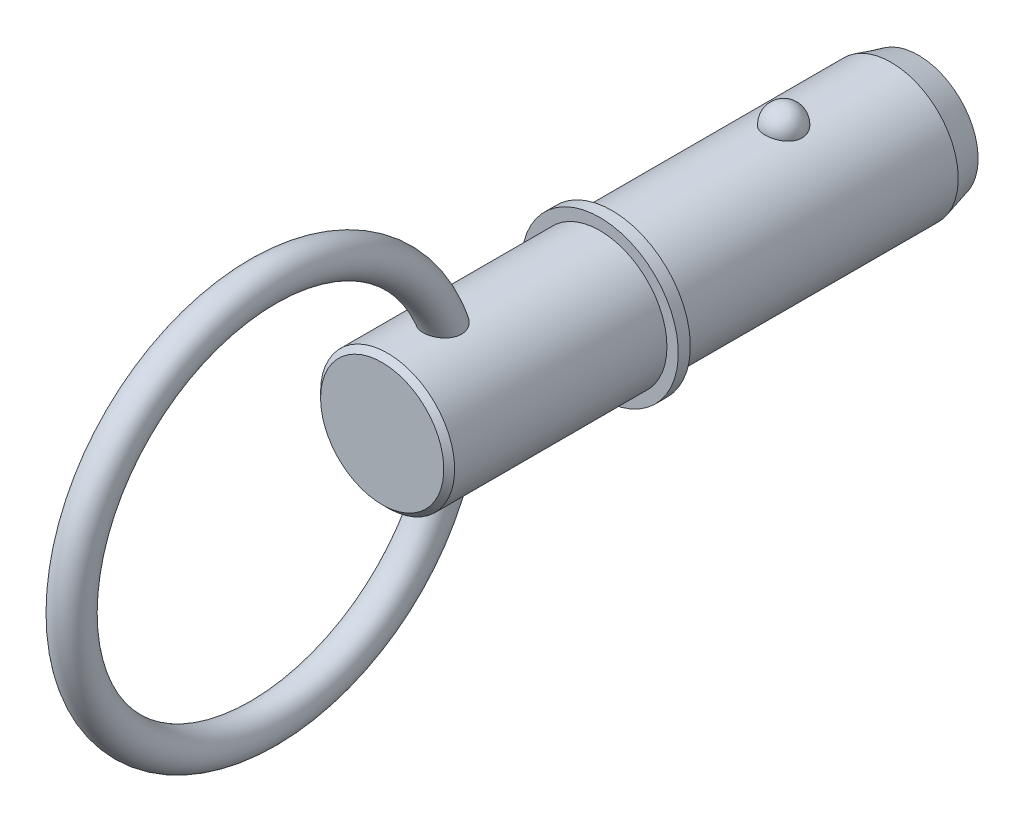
ISO-10303-21;
HEADER;
FILE_DESCRIPTION(('STEP AP214'),'2;1');
FILE_NAME('part.step','',(''),(''),'','','');
FILE_SCHEMA(('AUTOMOTIVE_DESIGN { 1 0 10303 214 1 1 1 1 }'));
ENDSEC;
DATA;
#1=APPLICATION_CONTEXT('core data for automotive mechanical design processes');
#2=APPLICATION_PROTOCOL_DEFINITION('international standard','automotive_design',2000,#1);
#3=PRODUCT_CONTEXT('',#1,'mechanical');
#4=PRODUCT('Part','Part','',(#3));
#5=PRODUCT_RELATED_PRODUCT_CATEGORY('part','',(#4));
#6=PRODUCT_DEFINITION_FORMATION('','',#4);
#7=PRODUCT_DEFINITION_CONTEXT('part definition',#1,'design');
#8=PRODUCT_DEFINITION('design','',#6,#7);
#9=PRODUCT_DEFINITION_SHAPE('','',#8);
#10=(LENGTH_UNIT() NAMED_UNIT(*) SI_UNIT(.MILLI.,.METRE.));
#11=(NAMED_UNIT(*) PLANE_ANGLE_UNIT() SI_UNIT($,.RADIAN.));
#12=(NAMED_UNIT(*) SI_UNIT($,.STERADIAN.) SOLID_ANGLE_UNIT());
#13=UNCERTAINTY_MEASURE_WITH_UNIT(LENGTH_MEASURE(1.E-05),#10,'distance_accuracy_value','');
#14=(GEOMETRIC_REPRESENTATION_CONTEXT(3) GLOBAL_UNCERTAINTY_ASSIGNED_CONTEXT((#13)) GLOBAL_UNIT_ASSIGNED_CONTEXT((#10,
#11,#12)) REPRESENTATION_CONTEXT('',''));
#15=CARTESIAN_POINT('',(0.,0.,0.));
#16=DIRECTION('',(0.,0.,1.));
#17=DIRECTION('',(1.,0.,0.));
#18=AXIS2_PLACEMENT_3D('',#15,#16,#17);
#19=CARTESIAN_POINT('',(0.,0.,25.4));
#20=DIRECTION('',(0.,0.,-1.));
#21=DIRECTION('',(-1.,0.,0.));
#22=AXIS2_PLACEMENT_3D('',#19,#20,#21);
#23=CYLINDRICAL_SURFACE('',#22,11.115);
#24=CARTESIAN_POINT('',(3.04058343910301,10.6910278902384,-3.06999999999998));
#25=CARTESIAN_POINT('',(3.04058039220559,10.6910304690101,-2.89837124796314));
#26=CARTESIAN_POINT('',(3.02657193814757,10.6950430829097,-2.72670368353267));
#27=CARTESIAN_POINT('',(2.97087341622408,10.7106465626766,-2.38822964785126));
#28=CARTESIAN_POINT('',(2.92917240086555,10.7222404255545,-2.22142512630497));
#29=CARTESIAN_POINT('',(2.81915317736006,10.751689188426,-1.8975081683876));
#30=CARTESIAN_POINT('',(2.75084669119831,10.7695413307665,-1.74039149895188));
#31=CARTESIAN_POINT('',(2.58932284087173,10.809510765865,-1.44013959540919));
#32=CARTESIAN_POINT('',(2.49610617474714,10.8316279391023,-1.29700396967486));
#33=CARTESIAN_POINT('',(2.28659317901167,10.877786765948,-1.02797591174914));
#34=CARTESIAN_POINT('',(2.17018825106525,10.9018371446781,-0.9021695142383));
#35=CARTESIAN_POINT('',(1.91759004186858,10.9490888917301,-0.672091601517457));
#36=CARTESIAN_POINT('',(1.78139672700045,10.9722902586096,-0.567820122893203));
#37=CARTESIAN_POINT('',(1.49327884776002,11.0151925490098,-0.383992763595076));
#38=CARTESIAN_POINT('',(1.34139928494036,11.034903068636,-0.304368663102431));
#39=CARTESIAN_POINT('',(1.0258482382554,11.0686948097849,-0.171731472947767));
#40=CARTESIAN_POINT('',(0.862178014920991,11.0827766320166,-0.118715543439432));
#41=CARTESIAN_POINT('',(0.530748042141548,11.1035404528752,-0.0415304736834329));
#42=CARTESIAN_POINT('',(0.363109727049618,11.1103474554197,-0.0168734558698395));
#43=CARTESIAN_POINT('',(0.0259327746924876,11.1162480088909,0.00453486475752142));
#44=CARTESIAN_POINT('',(-0.143605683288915,11.1153422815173,0.00128877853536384));
#45=CARTESIAN_POINT('',(-0.477280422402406,11.1059854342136,-0.0327676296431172));
#46=CARTESIAN_POINT('',(-0.641459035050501,11.0976393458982,-0.06319427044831));
#47=CARTESIAN_POINT('',(-0.962236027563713,11.0744390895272,-0.150220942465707));
#48=CARTESIAN_POINT('',(-1.11883427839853,11.0595848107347,-0.206821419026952));
#49=CARTESIAN_POINT('',(-1.4210461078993,11.0248420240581,-0.345028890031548));
#50=CARTESIAN_POINT('',(-1.56659244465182,11.0049254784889,-0.426775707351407));
#51=CARTESIAN_POINT('',(-1.84189316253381,10.9622119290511,-0.612956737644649));
#52=CARTESIAN_POINT('',(-1.97164597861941,10.9394146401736,-0.717393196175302));
#53=CARTESIAN_POINT('',(-2.21432263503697,10.8929139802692,-0.948332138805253));
#54=CARTESIAN_POINT('',(-2.3268890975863,10.8692016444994,-1.075208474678));
#55=CARTESIAN_POINT('',(-2.52940007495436,10.8238699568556,-1.34622145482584));
#56=CARTESIAN_POINT('',(-2.6193430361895,10.8022507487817,-1.49035928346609));
#57=CARTESIAN_POINT('',(-2.77523958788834,10.7632629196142,-1.79367507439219));
#58=CARTESIAN_POINT('',(-2.84091512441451,10.7459442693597,-1.95300253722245));
#59=CARTESIAN_POINT('',(-2.94519180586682,10.7178360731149,-2.28083009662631));
#60=CARTESIAN_POINT('',(-2.98379371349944,10.707046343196,-2.44932993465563));
#61=CARTESIAN_POINT('',(-3.03284665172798,10.6932559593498,-2.78998091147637));
#62=CARTESIAN_POINT('',(-3.04341313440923,10.6902233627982,-2.96211412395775));
#63=CARTESIAN_POINT('',(-3.03646037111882,10.6922002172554,-3.30576225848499));
#64=CARTESIAN_POINT('',(-3.0189418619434,10.6972094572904,-3.47727719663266));
#65=CARTESIAN_POINT('',(-2.95641582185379,10.7146564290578,-3.81396465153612));
#66=CARTESIAN_POINT('',(-2.91154117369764,10.7270582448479,-3.97916375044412));
#67=CARTESIAN_POINT('',(-2.79553341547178,10.7578713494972,-4.29947360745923));
#68=CARTESIAN_POINT('',(-2.72439927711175,10.7762828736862,-4.45458397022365));
#69=CARTESIAN_POINT('',(-2.55718900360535,10.8171819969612,-4.7512355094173));
#70=CARTESIAN_POINT('',(-2.46098224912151,10.8396907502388,-4.89270014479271));
#71=CARTESIAN_POINT('',(-2.24623042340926,10.8862165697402,-5.15724095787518));
#72=CARTESIAN_POINT('',(-2.12768452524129,10.9102336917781,-5.28031645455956));
#73=CARTESIAN_POINT('',(-1.87085107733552,10.9571990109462,-5.50509615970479));
#74=CARTESIAN_POINT('',(-1.73249451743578,10.9801430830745,-5.6067224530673));
#75=CARTESIAN_POINT('',(-1.44010079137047,11.0223008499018,-5.78517789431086));
#76=CARTESIAN_POINT('',(-1.28606470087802,11.0415148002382,-5.86200874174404));
#77=CARTESIAN_POINT('',(-0.968615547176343,11.0738491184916,-5.98788441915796));
#78=CARTESIAN_POINT('',(-0.805339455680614,11.0870408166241,-6.03725610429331));
#79=CARTESIAN_POINT('',(-0.472449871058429,11.1062048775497,-6.10820004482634));
#80=CARTESIAN_POINT('',(-0.302837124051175,11.11217808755,-6.12977556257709));
#81=CARTESIAN_POINT('',(0.0345765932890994,11.1162034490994,-6.14436196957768));
#82=CARTESIAN_POINT('',(0.202353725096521,11.1143988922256,-6.13788957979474));
#83=CARTESIAN_POINT('',(0.534364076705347,11.103390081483,-6.09773981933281));
#84=CARTESIAN_POINT('',(0.698597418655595,11.094186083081,-6.06406338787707));
#85=CARTESIAN_POINT('',(1.01830314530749,11.0694136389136,-5.97063285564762));
#86=CARTESIAN_POINT('',(1.17380497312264,11.0538682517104,-5.91097318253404));
#87=CARTESIAN_POINT('',(1.472484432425,11.0180608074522,-5.76723645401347));
#88=CARTESIAN_POINT('',(1.6156613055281,10.9977984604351,-5.68315789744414));
#89=CARTESIAN_POINT('',(1.88801614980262,10.9543574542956,-5.49138807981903));
#90=CARTESIAN_POINT('',(2.01695079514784,10.9311394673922,-5.38336024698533));
#91=CARTESIAN_POINT('',(2.25501495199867,10.8845248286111,-5.14733839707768));
#92=CARTESIAN_POINT('',(2.36414099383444,10.8611281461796,-5.01934088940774));
#93=CARTESIAN_POINT('',(2.56152595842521,10.8162958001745,-4.7444793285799));
#94=CARTESIAN_POINT('',(2.64940088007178,10.7948999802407,-4.59733288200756));
#95=CARTESIAN_POINT('',(2.79961494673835,10.7569242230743,-4.29001203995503));
#96=CARTESIAN_POINT('',(2.86196390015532,10.7403424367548,-4.12984267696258));
#97=CARTESIAN_POINT('',(2.95377333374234,10.715429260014,-3.82062342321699));
#98=CARTESIAN_POINT('',(2.98627018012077,10.7063495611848,-3.67252681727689));
#99=CARTESIAN_POINT('',(3.02967634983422,10.6941478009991,-3.37296350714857));
#100=CARTESIAN_POINT('',(3.04058612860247,10.6910256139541,-3.22149687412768));
#101=CARTESIAN_POINT('',(3.04058343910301,10.6910278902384,-3.06999999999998));
#102=B_SPLINE_CURVE_WITH_KNOTS('',3,(#24,#25,#26,#27,#28,#29,#30,#31,#32,#33,#34,#35,#36,#37,
#38,#39,#40,#41,#42,#43,#44,#45,#46,#47,#48,#49,#50,#51,#52,#53,#54,#55,#56,#57,#58,#59,#60,#61,
#62,#63,#64,#65,#66,#67,#68,#69,#70,#71,#72,#73,#74,#75,#76,#77,#78,#79,#80,#81,#82,#83,#84,#85,
#86,#87,#88,#89,#90,#91,#92,#93,#94,#95,#96,#97,#98,#99,#100,#101),.UNSPECIFIED.,.T.,.F.,(4,2,2,
2,2,2,2,2,2,2,2,2,2,2,2,2,2,2,2,2,2,2,2,2,2,2,2,2,2,2,2,2,2,2,2,2,2,2,4),(0.,0.514341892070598,
1.02888723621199,1.54320613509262,2.05751062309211,2.57428293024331,3.09105611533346,
3.60638589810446,4.1216606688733,4.62793159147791,5.13415514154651,5.63334381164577,
6.13254097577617,6.63456562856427,7.13663998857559,7.64804063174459,8.15947638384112,
8.67660265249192,9.19371435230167,9.70869321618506,10.223658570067,10.7361421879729,
11.2486458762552,11.7638748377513,12.2791228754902,12.7962115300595,13.3132647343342,
13.8240238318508,14.3347229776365,14.8360540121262,15.3373677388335,15.8368746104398,
16.3364121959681,16.8434736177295,17.3506237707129,17.8663484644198,18.3818748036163,
18.8358944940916,19.2899046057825),.UNSPECIFIED.);
#103=CARTESIAN_POINT('',(3.04058343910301,10.6910278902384,-3.06999999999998));
#104=VERTEX_POINT('',#103);
#105=EDGE_CURVE('E102',#104,#104,#102,.T.);
#106=ORIENTED_EDGE('',*,*,#105,.T.);
#107=EDGE_LOOP('',(#106));
#108=FACE_BOUND('',#107,.T.);
#109=CARTESIAN_POINT('',(0.,0.,-20.8999999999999));
#110=DIRECTION('',(0.,0.,-1.));
#111=DIRECTION('',(-1.,0.,0.));
#112=AXIS2_PLACEMENT_3D('',#109,#110,#111);
#113=CIRCLE('',#112,11.115);
#114=CARTESIAN_POINT('',(-11.115,0.,-20.8999999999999));
#115=VERTEX_POINT('',#114);
#116=EDGE_CURVE('E110',#115,#115,#113,.F.);
#117=ORIENTED_EDGE('',*,*,#116,.T.);
#118=EDGE_LOOP('',(#117));
#119=FACE_BOUND('',#118,.T.);
#120=CARTESIAN_POINT('',(0.,0.,25.4));
#121=DIRECTION('',(0.,0.,1.));
#122=DIRECTION('',(1.,0.,0.));
#123=AXIS2_PLACEMENT_3D('',#120,#121,#122);
#124=CIRCLE('',#123,11.115);
#125=CARTESIAN_POINT('',(11.115,0.,25.4));
#126=VERTEX_POINT('',#125);
#127=EDGE_CURVE('E108',#126,#126,#124,.T.);
#128=ORIENTED_EDGE('',*,*,#127,.F.);
#129=EDGE_LOOP('',(#128));
#130=FACE_BOUND('',#129,.T.);
#131=ADVANCED_FACE('F39',(#108,#119,#130),#23,.T.);
#132=CARTESIAN_POINT('',(0.,0.,-25.4));
#133=DIRECTION('',(0.,0.,-1.));
#134=DIRECTION('',(-1.,0.,0.));
#135=AXIS2_PLACEMENT_3D('',#132,#133,#134);
#136=PLANE('',#135);
#137=CARTESIAN_POINT('',(0.,0.,-25.4));
#138=DIRECTION('',(0.,0.,-1.));
#139=DIRECTION('',(-1.,0.,0.));
#140=AXIS2_PLACEMENT_3D('',#137,#138,#139);
#141=CIRCLE('',#140,9.90922863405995);
#142=CARTESIAN_POINT('',(-9.90922863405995,0.,-25.4));
#143=VERTEX_POINT('',#142);
#144=EDGE_CURVE('E143',#143,#143,#141,.T.);
#145=ORIENTED_EDGE('',*,*,#144,.T.);
#146=EDGE_LOOP('',(#145));
#147=FACE_BOUND('',#146,.T.);
#148=ADVANCED_FACE('F88',(#147),#136,.T.);
#149=CARTESIAN_POINT('',(0.,0.,-25.4));
#150=DIRECTION('',(0.,0.,1.));
#151=DIRECTION('',(1.,0.,0.));
#152=AXIS2_PLACEMENT_3D('',#149,#150,#151);
#153=CONICAL_SURFACE('',#152,9.90922863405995,0.261799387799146);
#154=ORIENTED_EDGE('',*,*,#116,.F.);
#155=EDGE_LOOP('',(#154));
#156=FACE_BOUND('',#155,.T.);
#157=ORIENTED_EDGE('',*,*,#144,.F.);
#158=EDGE_LOOP('',(#157));
#159=FACE_BOUND('',#158,.T.);
#160=ADVANCED_FACE('F94',(#156,#159),#153,.T.);
#161=CARTESIAN_POINT('',(0.,11.115,-3.06999999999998));
#162=DIRECTION('',(0.,1.,0.));
#163=DIRECTION('',(0.,0.,-1.));
#164=AXIS2_PLACEMENT_3D('',#161,#162,#163);
#165=SPHERICAL_SURFACE('',#164,3.07);
#166=ORIENTED_EDGE('',*,*,#105,.F.);
#167=EDGE_LOOP('',(#166));
#168=FACE_BOUND('',#167,.T.);
#169=ADVANCED_FACE('F113',(#168),#165,.T.);
#170=CARTESIAN_POINT('',(0.,0.,25.4));
#171=DIRECTION('',(0.,0.,-1.));
#172=DIRECTION('',(-1.,0.,0.));
#173=AXIS2_PLACEMENT_3D('',#170,#171,#172);
#174=PLANE('',#173);
#175=ORIENTED_EDGE('',*,*,#127,.T.);
#176=EDGE_LOOP('',(#175));
#177=FACE_BOUND('',#176,.T.);
#178=CARTESIAN_POINT('',(0.,0.,25.4));
#179=DIRECTION('',(0.,0.,-1.));
#180=DIRECTION('',(-1.,0.,0.));
#181=AXIS2_PLACEMENT_3D('',#178,#179,#180);
#182=CIRCLE('',#181,13.);
#183=CARTESIAN_POINT('',(-13.,0.,25.4));
#184=VERTEX_POINT('',#183);
#185=EDGE_CURVE('E109',#184,#184,#182,.T.);
#186=ORIENTED_EDGE('',*,*,#185,.T.);
#187=EDGE_LOOP('',(#186));
#188=FACE_BOUND('',#187,.T.);
#189=ADVANCED_FACE('F117',(#177,#188),#174,.T.);
#190=CARTESIAN_POINT('',(0.,0.,33.7287874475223));
#191=DIRECTION('',(0.,0.,-1.));
#192=DIRECTION('',(-1.,0.,0.));
#193=AXIS2_PLACEMENT_3D('',#190,#191,#192);
#194=CYLINDRICAL_SURFACE('',#193,13.);
#195=CARTESIAN_POINT('',(0.,0.,27.4));
#196=DIRECTION('',(0.,0.,-1.));
#197=DIRECTION('',(-1.,0.,0.));
#198=AXIS2_PLACEMENT_3D('',#195,#196,#197);
#199=CIRCLE('',#198,13.);
#200=CARTESIAN_POINT('',(-13.,0.,27.4));
#201=VERTEX_POINT('',#200);
#202=EDGE_CURVE('E134',#201,#201,#199,.T.);
#203=ORIENTED_EDGE('',*,*,#202,.T.);
#204=EDGE_LOOP('',(#203));
#205=FACE_BOUND('',#204,.T.);
#206=ORIENTED_EDGE('',*,*,#185,.F.);
#207=EDGE_LOOP('',(#206));
#208=FACE_BOUND('',#207,.T.);
#209=ADVANCED_FACE('F121',(#205,#208),#194,.T.);
#210=CARTESIAN_POINT('',(0.,13.,27.4));
#211=DIRECTION('',(0.,0.,1.));
#212=DIRECTION('',(1.,0.,0.));
#213=AXIS2_PLACEMENT_3D('',#210,#211,#212);
#214=PLANE('',#213);
#215=CARTESIAN_POINT('',(0.,0.,27.4));
#216=DIRECTION('',(0.,0.,1.));
#217=DIRECTION('',(1.,0.,0.));
#218=AXIS2_PLACEMENT_3D('',#215,#216,#217);
#219=CIRCLE('',#218,11.115);
#220=CARTESIAN_POINT('',(11.115,0.,27.4));
#221=VERTEX_POINT('',#220);
#222=EDGE_CURVE('E112',#221,#221,#219,.T.);
#223=ORIENTED_EDGE('',*,*,#222,.F.);
#224=EDGE_LOOP('',(#223));
#225=FACE_BOUND('',#224,.T.);
#226=ORIENTED_EDGE('',*,*,#202,.F.);
#227=EDGE_LOOP('',(#226));
#228=FACE_BOUND('',#227,.T.);
#229=ADVANCED_FACE('F85',(#225,#228),#214,.T.);
#230=CARTESIAN_POINT('',(0.,0.,63.5));
#231=DIRECTION('',(0.,0.,-1.));
#232=DIRECTION('',(-1.,0.,0.));
#233=AXIS2_PLACEMENT_3D('',#230,#231,#232);
#234=CYLINDRICAL_SURFACE('',#233,11.115);
#235=CARTESIAN_POINT('',(-1.22435852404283,-11.0473603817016,50.5784197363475));
#236=CARTESIAN_POINT('',(-1.07078016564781,-11.0643805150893,50.5116991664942));
#237=CARTESIAN_POINT('',(-0.911372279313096,-11.0787777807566,50.4577454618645));
#238=CARTESIAN_POINT('',(-0.585451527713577,-11.1007717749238,50.3765522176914));
#239=CARTESIAN_POINT('',(-0.418938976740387,-11.1083688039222,50.3493114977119));
#240=CARTESIAN_POINT('',(-0.0835394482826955,-11.1159515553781,50.3221212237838));
#241=CARTESIAN_POINT('',(0.0853474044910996,-11.1159376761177,50.3221702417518));
#242=CARTESIAN_POINT('',(0.420723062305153,-11.1083011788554,50.3495547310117));
#243=CARTESIAN_POINT('',(0.587211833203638,-11.1006784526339,50.3768905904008));
#244=CARTESIAN_POINT('',(0.913189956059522,-11.0786293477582,50.4582995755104));
#245=CARTESIAN_POINT('',(1.07267378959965,-11.0641977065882,50.5123933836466));
#246=CARTESIAN_POINT('',(1.37994044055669,-11.0300907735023,50.6461408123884));
#247=CARTESIAN_POINT('',(1.52772335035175,-11.0104155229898,50.7257942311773));
#248=CARTESIAN_POINT('',(1.80679367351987,-10.9680716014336,50.9084678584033));
#249=CARTESIAN_POINT('',(1.93814041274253,-10.945414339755,51.0114000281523));
#250=CARTESIAN_POINT('',(2.18117403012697,-10.8995884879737,51.238212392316));
#251=CARTESIAN_POINT('',(2.29286356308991,-10.8764199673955,51.3620897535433));
#252=CARTESIAN_POINT('',(2.49238969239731,-10.8324319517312,51.6259926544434));
#253=CARTESIAN_POINT('',(2.58046870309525,-10.8115899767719,51.7658312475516));
#254=CARTESIAN_POINT('',(2.73218762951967,-10.7742522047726,52.0586913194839));
#255=CARTESIAN_POINT('',(2.79582945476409,-10.757756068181,52.2117117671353));
#256=CARTESIAN_POINT('',(2.89767977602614,-10.7307723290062,52.5266092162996));
#257=CARTESIAN_POINT('',(2.93586554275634,-10.7202900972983,52.688493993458));
#258=CARTESIAN_POINT('',(2.98678800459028,-10.7062139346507,53.0164805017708));
#259=CARTESIAN_POINT('',(2.99951894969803,-10.7026215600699,53.1825831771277));
#260=CARTESIAN_POINT('',(3.0004780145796,-10.7023530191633,53.5232270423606));
#261=CARTESIAN_POINT('',(2.98743421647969,-10.7060358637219,53.6977701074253));
#262=CARTESIAN_POINT('',(2.93592917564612,-10.7202719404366,54.0427508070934));
#263=CARTESIAN_POINT('',(2.8974582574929,-10.7308277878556,54.2131868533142));
#264=CARTESIAN_POINT('',(2.79180512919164,-10.7588257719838,54.5631149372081));
#265=CARTESIAN_POINT('',(2.72213928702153,-10.776850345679,54.7418115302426));
#266=CARTESIAN_POINT('',(2.5561284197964,-10.8174264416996,55.0859744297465));
#267=CARTESIAN_POINT('',(2.4597569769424,-10.8399824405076,55.2514274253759));
#268=CARTESIAN_POINT('',(2.23434632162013,-10.8887625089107,55.575672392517));
#269=CARTESIAN_POINT('',(2.10349593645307,-10.9151327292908,55.7331925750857));
#270=CARTESIAN_POINT('',(1.81505097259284,-10.96677510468,56.0216682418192));
#271=CARTESIAN_POINT('',(1.65749731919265,-10.9920488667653,56.1526637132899));
#272=CARTESIAN_POINT('',(1.36197799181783,-11.0319737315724,56.3513134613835));
#273=CARTESIAN_POINT('',(1.22927684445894,-11.0476896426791,56.4266009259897));
#274=CARTESIAN_POINT('',(0.952979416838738,-11.0749380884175,56.5545744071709));
#275=CARTESIAN_POINT('',(0.809393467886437,-11.0864745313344,56.6072815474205));
#276=CARTESIAN_POINT('',(0.513954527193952,-11.1041011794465,56.6870588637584));
#277=CARTESIAN_POINT('',(0.362058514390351,-11.1101594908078,56.7139789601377));
#278=CARTESIAN_POINT('',(0.0557792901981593,-11.1159132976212,56.7395595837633));
#279=CARTESIAN_POINT('',(-0.098603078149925,-11.1156109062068,56.7382294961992));
#280=CARTESIAN_POINT('',(-0.389768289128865,-11.1090283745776,56.7089352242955));
#281=CARTESIAN_POINT('',(-0.526830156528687,-11.1033186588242,56.6835124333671));
#282=CARTESIAN_POINT('',(-0.794878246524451,-11.0873547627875,56.6112701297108));
#283=CARTESIAN_POINT('',(-0.925863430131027,-11.0770998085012,56.5644469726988));
#284=CARTESIAN_POINT('',(-1.18354406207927,-11.0525934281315,56.4498438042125));
#285=CARTESIAN_POINT('',(-1.30991621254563,-11.0382116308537,56.3813711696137));
#286=CARTESIAN_POINT('',(-1.55122352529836,-11.0068962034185,56.2271312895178));
#287=CARTESIAN_POINT('',(-1.66615377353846,-10.9899614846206,56.1413566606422));
#288=CARTESIAN_POINT('',(-1.90024050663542,-10.9520991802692,55.9408720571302));
#289=CARTESIAN_POINT('',(-2.01728342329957,-10.9309598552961,55.8237372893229));
#290=CARTESIAN_POINT('',(-2.23333659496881,-10.8888735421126,55.5738397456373));
#291=CARTESIAN_POINT('',(-2.33233396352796,-10.8679267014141,55.4410659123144));
#292=CARTESIAN_POINT('',(-2.52607041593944,-10.8246766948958,55.1400006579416));
#293=CARTESIAN_POINT('',(-2.61741570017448,-10.8027194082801,54.9694627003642));
#294=CARTESIAN_POINT('',(-2.77251687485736,-10.7639568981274,54.6156715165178));
#295=CARTESIAN_POINT('',(-2.83625783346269,-10.7471544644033,54.4324114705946));
#296=CARTESIAN_POINT('',(-2.93668505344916,-10.7201706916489,54.0466242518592));
#297=CARTESIAN_POINT('',(-2.97161961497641,-10.7104219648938,53.843594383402));
#298=CARTESIAN_POINT('',(-2.99683495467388,-10.7033740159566,53.5368749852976));
#299=CARTESIAN_POINT('',(-3.00070536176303,-10.7022882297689,53.4342341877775));
#300=CARTESIAN_POINT('',(-2.99908594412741,-10.7027439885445,53.2290499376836));
#301=CARTESIAN_POINT('',(-2.99360154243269,-10.7042840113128,53.1265064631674));
#302=CARTESIAN_POINT('',(-2.97382504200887,-10.7097936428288,52.9303300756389));
#303=CARTESIAN_POINT('',(-2.9602439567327,-10.7135669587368,52.8366192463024));
#304=CARTESIAN_POINT('',(-2.92480741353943,-10.723295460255,52.650932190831));
#305=CARTESIAN_POINT('',(-2.90295619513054,-10.7292495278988,52.5589551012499));
#306=CARTESIAN_POINT('',(-2.85097003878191,-10.7431800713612,52.3775474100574));
#307=CARTESIAN_POINT('',(-2.82083748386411,-10.7511559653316,52.2881160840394));
#308=CARTESIAN_POINT('',(-2.75241691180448,-10.7688750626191,52.1126453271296));
#309=CARTESIAN_POINT('',(-2.71412954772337,-10.7786181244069,52.0266056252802));
#310=CARTESIAN_POINT('',(-2.59550576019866,-10.807996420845,51.7910554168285));
#311=CARTESIAN_POINT('',(-2.50612224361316,-10.8292837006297,51.6461731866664));
#312=CARTESIAN_POINT('',(-2.30366035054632,-10.8741467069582,51.3745713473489));
#313=CARTESIAN_POINT('',(-2.19058370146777,-10.8977222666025,51.2478504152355));
#314=CARTESIAN_POINT('',(-1.94442412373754,-10.9443154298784,51.0164621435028));
#315=CARTESIAN_POINT('',(-1.81141354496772,-10.967334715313,50.9117182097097));
#316=CARTESIAN_POINT('',(-1.52904284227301,-11.0102504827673,50.7264358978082));
#317=CARTESIAN_POINT('',(-1.37968206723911,-11.0301468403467,50.6458984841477));
#318=CARTESIAN_POINT('',(-1.22435852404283,-11.0473603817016,50.5784197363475));
#319=B_SPLINE_CURVE_WITH_KNOTS('',3,(#235,#236,#237,#238,#239,#240,#241,#242,#243,#244,#245,
#246,#247,#248,#249,#250,#251,#252,#253,#254,#255,#256,#257,#258,#259,#260,#261,#262,#263,#264,
#265,#266,#267,#268,#269,#270,#271,#272,#273,#274,#275,#276,#277,#278,#279,#280,#281,#282,#283,
#284,#285,#286,#287,#288,#289,#290,#291,#292,#293,#294,#295,#296,#297,#298,#299,#300,#301,#302,
#303,#304,#305,#306,#307,#308,#309,#310,#311,#312,#313,#314,#315,#316,#317,#318),.UNSPECIFIED.,
.T.,.F.,(4,2,2,2,2,2,2,2,2,2,2,2,2,2,2,2,2,2,2,2,2,2,2,2,2,2,2,2,2,2,2,2,2,2,2,2,2,2,2,2,2,4),
(0.,0.504317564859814,1.00861284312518,1.51288173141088,2.01715779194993,2.52182424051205,
3.02648670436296,3.52927157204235,4.03198848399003,4.52932690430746,5.02662645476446,
5.52436944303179,6.0222248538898,6.545261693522,7.06849767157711,7.64398785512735,
8.22004937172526,8.83633461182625,9.4516837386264,9.90997173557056,10.3678300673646,
10.8283372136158,11.2886913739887,11.7053264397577,12.1220324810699,12.5537129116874,
12.9855779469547,13.4844842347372,13.9837454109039,14.5653303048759,15.1472294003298,
15.762338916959,16.0701226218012,16.3777279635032,16.6616380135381,16.9454027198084,
17.229085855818,17.5127462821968,18.0246262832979,18.5364689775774,19.0464970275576,
19.5565453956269),.UNSPECIFIED.);
#320=CARTESIAN_POINT('',(-1.22435852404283,-11.0473603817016,50.5784197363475));
#321=VERTEX_POINT('',#320);
#322=EDGE_CURVE('E10',#321,#321,#319,.T.);
#323=ORIENTED_EDGE('',*,*,#322,.F.);
#324=EDGE_LOOP('',(#323));
#325=FACE_BOUND('',#324,.T.);
#326=CARTESIAN_POINT('',(-1.22435852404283,11.0473603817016,50.5784197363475));
#327=CARTESIAN_POINT('',(-1.37630771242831,11.0305212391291,50.644431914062));
#328=CARTESIAN_POINT('',(-1.52254325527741,11.0111158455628,50.7229381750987));
#329=CARTESIAN_POINT('',(-1.7994538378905,10.9692671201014,50.9031533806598));
#330=CARTESIAN_POINT('',(-1.93013010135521,10.9468240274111,51.0048604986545));
#331=CARTESIAN_POINT('',(-2.17227655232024,10.9013603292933,51.2290359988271));
#332=CARTESIAN_POINT('',(-2.28373752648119,10.8783394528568,51.3515142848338));
#333=CARTESIAN_POINT('',(-2.4842745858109,10.8343057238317,51.6138954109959));
#334=CARTESIAN_POINT('',(-2.57335330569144,10.8132926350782,51.7537961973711));
#335=CARTESIAN_POINT('',(-2.72640074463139,10.7757209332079,52.0459648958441));
#336=CARTESIAN_POINT('',(-2.79054231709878,10.7591319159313,52.1981385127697));
#337=CARTESIAN_POINT('',(-2.89354234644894,10.7318913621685,52.5112862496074));
#338=CARTESIAN_POINT('',(-2.93239912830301,10.7212402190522,52.6722609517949));
#339=CARTESIAN_POINT('',(-2.98540436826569,10.7066038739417,53.0019559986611));
#340=CARTESIAN_POINT('',(-2.99901659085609,10.7027634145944,53.1707680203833));
#341=CARTESIAN_POINT('',(-3.00088147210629,10.7022388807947,53.5085087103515));
#342=CARTESIAN_POINT('',(-2.98912652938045,10.7055569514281,53.6774373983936));
#343=CARTESIAN_POINT('',(-2.93985175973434,10.7191979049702,54.0248560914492));
#344=CARTESIAN_POINT('',(-2.90036626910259,10.7300544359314,54.2030445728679));
#345=CARTESIAN_POINT('',(-2.7955500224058,10.7578360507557,54.5512150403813));
#346=CARTESIAN_POINT('',(-2.73019988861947,10.774765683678,54.7211907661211));
#347=CARTESIAN_POINT('',(-2.56762574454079,10.8147227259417,55.0657841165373));
#348=CARTESIAN_POINT('',(-2.46786230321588,10.838191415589,55.2391574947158));
#349=CARTESIAN_POINT('',(-2.24100420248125,10.8873575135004,55.5666868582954));
#350=CARTESIAN_POINT('',(-2.11391925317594,10.9130541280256,55.7208496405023));
#351=CARTESIAN_POINT('',(-1.85542700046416,10.9597063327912,55.9827355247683));
#352=CARTESIAN_POINT('',(-1.72758345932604,10.9807909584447,56.0939559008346));
#353=CARTESIAN_POINT('',(-1.45489931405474,11.0202250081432,56.2941223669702));
#354=CARTESIAN_POINT('',(-1.31006770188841,11.0385758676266,56.3830801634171));
#355=CARTESIAN_POINT('',(-1.08171164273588,11.0625084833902,56.4963702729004));
#356=CARTESIAN_POINT('',(-1.0033223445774,11.069914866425,56.5308967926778));
#357=CARTESIAN_POINT('',(-0.84352596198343,11.0832350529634,56.5923914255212));
#358=CARTESIAN_POINT('',(-0.762120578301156,11.0891496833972,56.6193637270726));
#359=CARTESIAN_POINT('',(-0.597014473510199,11.0992628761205,56.6651819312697));
#360=CARTESIAN_POINT('',(-0.513315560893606,11.1034627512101,56.6840340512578));
#361=CARTESIAN_POINT('',(-0.344374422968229,11.1099851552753,56.7132096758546));
#362=CARTESIAN_POINT('',(-0.259132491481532,11.1123080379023,56.7235347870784));
#363=CARTESIAN_POINT('',(-0.100838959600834,11.114780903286,56.7345196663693));
#364=CARTESIAN_POINT('',(-0.0278735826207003,11.1152042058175,56.736395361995));
#365=CARTESIAN_POINT('',(0.117962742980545,11.1146132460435,56.7337734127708));
#366=CARTESIAN_POINT('',(0.190833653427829,11.1135985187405,56.7292737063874));
#367=CARTESIAN_POINT('',(0.335842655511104,11.110161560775,56.7139786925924));
#368=CARTESIAN_POINT('',(0.407981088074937,11.1077400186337,56.7031864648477));
#369=CARTESIAN_POINT('',(0.551029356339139,11.1015643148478,56.675503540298));
#370=CARTESIAN_POINT('',(0.621938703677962,11.0978096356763,56.6586104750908));
#371=CARTESIAN_POINT('',(0.825381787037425,11.0851145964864,56.6010547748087));
#372=CARTESIAN_POINT('',(0.955713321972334,11.0745538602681,56.5527059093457));
#373=CARTESIAN_POINT('',(1.20733127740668,11.0499605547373,56.4373252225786));
#374=CARTESIAN_POINT('',(1.32861527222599,11.0359270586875,56.3702884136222));
#375=CARTESIAN_POINT('',(1.5734436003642,11.0038352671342,56.2118439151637));
#376=CARTESIAN_POINT('',(1.69572941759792,10.9855025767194,56.1185512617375));
#377=CARTESIAN_POINT('',(1.92565215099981,10.9475431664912,55.9156505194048));
#378=CARTESIAN_POINT('',(2.03328016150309,10.9279156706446,55.8060325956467));
#379=CARTESIAN_POINT('',(2.25048911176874,10.8854412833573,55.5529911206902));
#380=CARTESIAN_POINT('',(2.35710396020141,10.8626332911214,55.4070101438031));
#381=CARTESIAN_POINT('',(2.54757318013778,10.8195493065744,55.100478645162));
#382=CARTESIAN_POINT('',(2.63141052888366,10.799275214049,54.9399173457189));
#383=CARTESIAN_POINT('',(2.78342312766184,10.7611645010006,54.5878272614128));
#384=CARTESIAN_POINT('',(2.84851472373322,10.7439117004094,54.3948938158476));
#385=CARTESIAN_POINT('',(2.94562652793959,10.7177011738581,54.0001309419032));
#386=CARTESIAN_POINT('',(2.97764942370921,10.7087427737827,53.7983022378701));
#387=CARTESIAN_POINT('',(2.99864828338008,10.7028651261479,53.4959897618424));
#388=CARTESIAN_POINT('',(3.00125529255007,10.7021342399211,53.3963789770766));
#389=CARTESIAN_POINT('',(2.9976304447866,10.7031517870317,53.1973450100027));
#390=CARTESIAN_POINT('',(2.99140295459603,10.704898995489,53.0979217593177));
#391=CARTESIAN_POINT('',(2.96990080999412,10.710883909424,52.9001790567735));
#392=CARTESIAN_POINT('',(2.95463019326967,10.7151205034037,52.8018591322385));
#393=CARTESIAN_POINT('',(2.91493260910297,10.7259879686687,52.6072196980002));
#394=CARTESIAN_POINT('',(2.89050674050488,10.7326185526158,52.5108999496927));
#395=CARTESIAN_POINT('',(2.83556656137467,10.7472556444,52.3312221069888));
#396=CARTESIAN_POINT('',(2.80596337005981,10.7550439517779,52.2475666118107));
#397=CARTESIAN_POINT('',(2.7395310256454,10.7721572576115,52.0833000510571));
#398=CARTESIAN_POINT('',(2.70269935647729,10.7814827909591,52.0026900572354));
#399=CARTESIAN_POINT('',(2.6220344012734,10.801383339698,51.8452733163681));
#400=CARTESIAN_POINT('',(2.57820565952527,10.8119575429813,51.7684641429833));
#401=CARTESIAN_POINT('',(2.48382482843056,10.8340293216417,51.6192237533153));
#402=CARTESIAN_POINT('',(2.43327032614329,10.8455272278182,51.546794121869));
#403=CARTESIAN_POINT('',(2.27895739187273,10.879345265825,51.3459926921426));
#404=CARTESIAN_POINT('',(2.16717186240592,10.9023791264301,51.2237643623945));
#405=CARTESIAN_POINT('',(1.92442677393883,10.9478318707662,51.0001515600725));
#406=CARTESIAN_POINT('',(1.79346836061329,10.9702507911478,50.898765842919));
#407=CARTESIAN_POINT('',(1.51657151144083,11.0119360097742,50.7195646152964));
#408=CARTESIAN_POINT('',(1.37069187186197,11.0312139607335,50.6416610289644));
#409=CARTESIAN_POINT('',(1.06764402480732,11.0646548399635,50.5106801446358));
#410=CARTESIAN_POINT('',(0.910475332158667,11.0788175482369,50.4576039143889));
#411=CARTESIAN_POINT('',(0.58749288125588,11.1006548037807,50.37697871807));
#412=CARTESIAN_POINT('',(0.421604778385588,11.1082585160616,50.3497081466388));
#413=CARTESIAN_POINT('',(0.0874262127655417,11.1159127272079,50.3222592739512));
#414=CARTESIAN_POINT('',(-0.0808643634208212,11.1159628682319,50.3220822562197));
#415=CARTESIAN_POINT('',(-0.41625274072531,11.1084780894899,50.3489180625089));
#416=CARTESIAN_POINT('',(-0.583334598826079,11.1008914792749,50.376116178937));
#417=CARTESIAN_POINT('',(-0.910355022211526,11.0788693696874,50.4574015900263));
#418=CARTESIAN_POINT('',(-1.07029370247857,11.064433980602,50.5114884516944));
#419=CARTESIAN_POINT('',(-1.22435852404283,11.0473603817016,50.5784197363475));
#420=B_SPLINE_CURVE_WITH_KNOTS('',3,(#326,#327,#328,#329,#330,#331,#332,#333,#334,#335,#336,
#337,#338,#339,#340,#341,#342,#343,#344,#345,#346,#347,#348,#349,#350,#351,#352,#353,#354,#355,
#356,#357,#358,#359,#360,#361,#362,#363,#364,#365,#366,#367,#368,#369,#370,#371,#372,#373,#374,
#375,#376,#377,#378,#379,#380,#381,#382,#383,#384,#385,#386,#387,#388,#389,#390,#391,#392,#393,
#394,#395,#396,#397,#398,#399,#400,#401,#402,#403,#404,#405,#406,#407,#408,#409,#410,#411,#412,
#413,#414,#415,#416,#417,#418,#419),.UNSPECIFIED.,.T.,.F.,(4,2,2,2,2,2,2,2,2,2,2,2,2,2,2,2,2,2,
2,2,2,2,2,2,2,2,2,2,2,2,2,2,2,2,2,2,2,2,2,2,2,2,2,2,2,2,4),(0.,0.498977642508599,
0.997916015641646,1.49709295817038,1.99621111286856,2.49180514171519,2.98743199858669,
3.49347125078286,3.99966216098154,4.54591839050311,5.09258465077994,5.69407889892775,
6.29535972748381,6.80565832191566,7.31568801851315,7.57328514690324,7.83073916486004,
8.08799570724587,8.34520376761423,8.56389164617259,8.78265025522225,9.00130188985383,
9.22003849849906,9.63638938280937,10.0528514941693,10.5157946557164,10.9790178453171,
11.5234572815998,12.0683024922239,12.6784825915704,13.288613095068,13.5872082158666,
13.8856557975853,14.1839702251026,14.482248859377,14.7491407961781,15.016125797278,
15.2829381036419,15.5498463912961,16.0489312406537,16.5479862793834,17.0451454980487,
17.5423260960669,18.0448111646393,18.5473200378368,19.0532532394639,19.5591782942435),.UNSPECIFIED.);
#421=CARTESIAN_POINT('',(-1.22435852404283,11.0473603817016,50.5784197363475));
#422=VERTEX_POINT('',#421);
#423=EDGE_CURVE('E51',#422,#422,#420,.T.);
#424=ORIENTED_EDGE('',*,*,#423,.F.);
#425=EDGE_LOOP('',(#424));
#426=FACE_BOUND('',#425,.T.);
#427=CARTESIAN_POINT('',(0.,0.,62.6));
#428=DIRECTION('',(0.,0.,-1.));
#429=DIRECTION('',(-1.,0.,0.));
#430=AXIS2_PLACEMENT_3D('',#427,#428,#429);
#431=CIRCLE('',#430,11.115);
#432=CARTESIAN_POINT('',(-11.115,0.,62.6));
#433=VERTEX_POINT('',#432);
#434=EDGE_CURVE('E64',#433,#433,#431,.T.);
#435=ORIENTED_EDGE('',*,*,#434,.T.);
#436=EDGE_LOOP('',(#435));
#437=FACE_BOUND('',#436,.T.);
#438=ORIENTED_EDGE('',*,*,#222,.T.);
#439=EDGE_LOOP('',(#438));
#440=FACE_BOUND('',#439,.T.);
#441=ADVANCED_FACE('F69',(#325,#426,#437,#440),#234,.T.);
#442=CARTESIAN_POINT('',(0.,0.,63.5));
#443=DIRECTION('',(0.,0.,-1.));
#444=DIRECTION('',(-1.,0.,0.));
#445=AXIS2_PLACEMENT_3D('',#442,#443,#444);
#446=PLANE('',#445);
#447=CARTESIAN_POINT('',(0.,0.,63.5));
#448=DIRECTION('',(0.,0.,-1.));
#449=DIRECTION('',(-1.,0.,0.));
#450=AXIS2_PLACEMENT_3D('',#447,#448,#449);
#451=CIRCLE('',#450,10.215);
#452=CARTESIAN_POINT('',(-10.215,0.,63.5));
#453=VERTEX_POINT('',#452);
#454=EDGE_CURVE('E57',#453,#453,#451,.F.);
#455=ORIENTED_EDGE('',*,*,#454,.T.);
#456=EDGE_LOOP('',(#455));
#457=FACE_BOUND('',#456,.T.);
#458=ADVANCED_FACE('F76',(#457),#446,.F.);
#459=CARTESIAN_POINT('',(0.,0.,62.6));
#460=DIRECTION('',(0.,0.,-1.));
#461=DIRECTION('',(-1.,0.,0.));
#462=AXIS2_PLACEMENT_3D('',#459,#460,#461);
#463=CONICAL_SURFACE('',#462,11.115,0.785398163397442);
#464=ORIENTED_EDGE('',*,*,#454,.F.);
#465=EDGE_LOOP('',(#464));
#466=FACE_BOUND('',#465,.T.);
#467=ORIENTED_EDGE('',*,*,#434,.F.);
#468=EDGE_LOOP('',(#467));
#469=FACE_BOUND('',#468,.T.);
#470=ADVANCED_FACE('F41',(#466,#469),#463,.T.);
#471=CARTESIAN_POINT('',(0.,0.,83.25));
#472=DIRECTION('',(1.,0.,0.));
#473=DIRECTION('',(0.,0.,-1.));
#474=AXIS2_PLACEMENT_3D('',#471,#472,#473);
#475=TOROIDAL_SURFACE('',#474,31.75,3.);
#476=ORIENTED_EDGE('',*,*,#322,.T.);
#477=EDGE_LOOP('',(#476));
#478=FACE_BOUND('',#477,.T.);
#479=ORIENTED_EDGE('',*,*,#423,.T.);
#480=EDGE_LOOP('',(#479));
#481=FACE_BOUND('',#480,.T.);
#482=ADVANCED_FACE('F73',(#478,#481),#475,.T.);
#483=CLOSED_SHELL('',(#131,#148,#160,#169,#189,#209,#229,#441,#458,#470,#482));
#484=MANIFOLD_SOLID_BREP('B2',#483);
#485=ADVANCED_BREP_SHAPE_REPRESENTATION('',(#18,#484),#14);
#486=SHAPE_DEFINITION_REPRESENTATION(#9,#485);
ENDSEC;
END-ISO-10303-21;
